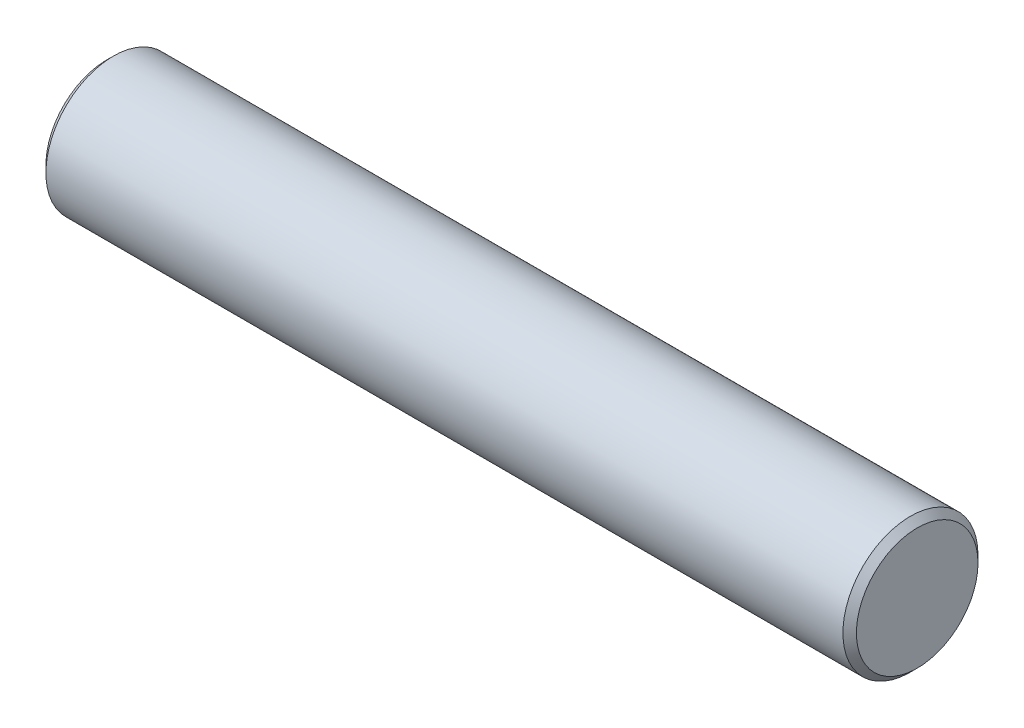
from build123d import *

# Parameters (mm, degrees)
SKETCH1_R           = 1
BOSS_EXTRUDE1_DEPTH = 12
CHAMFER1_SIZE       = 0.1
CHAMFER2_SIZE       = 0.1


with BuildPart() as part:
    # Sketch1 → Boss-Extrude1 (new body)
    with BuildSketch(Plane(origin=(0, 0, 0), x_dir=(0, 0, -1), z_dir=(1, 0, 0))):
        Circle(SKETCH1_R)
    extrude(amount=BOSS_EXTRUDE1_DEPTH)

    # Chamfer1
    chamfer1_edges = [part.edges().sort_by_distance(p)[0] for p in [
        (0, 0, 1),
    ]]
    chamfer(chamfer1_edges, length=CHAMFER1_SIZE)

    # Chamfer2
    chamfer2_edges = [part.edges().sort_by_distance(p)[0] for p in [
        (12, 0, 1),
    ]]
    chamfer(chamfer2_edges, length=CHAMFER2_SIZE)


solid = part.part
